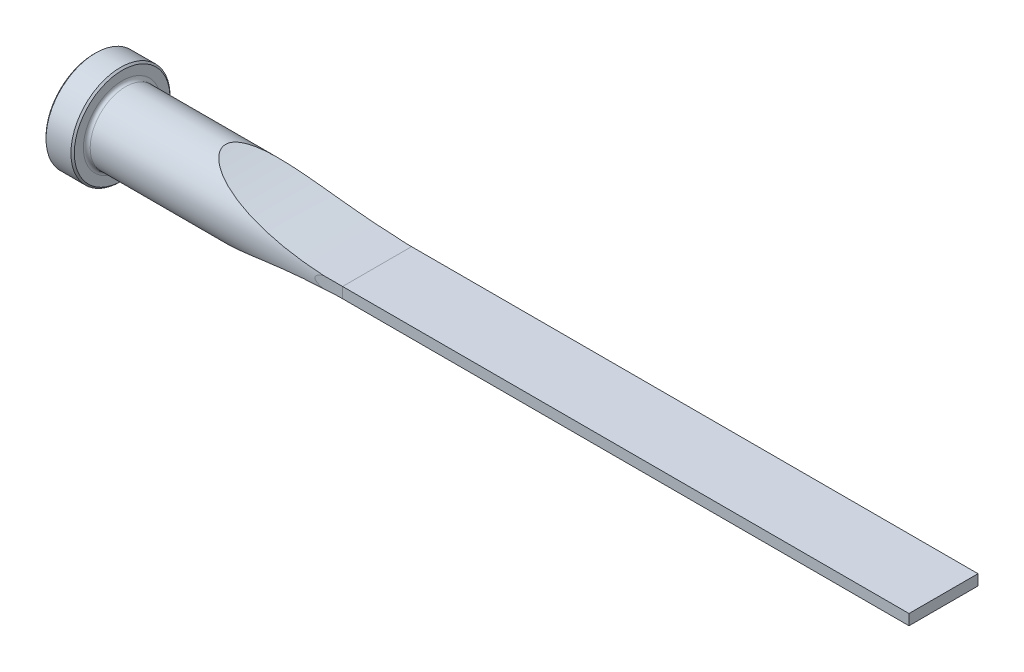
ISO-10303-21;
HEADER;
FILE_DESCRIPTION(('STEP AP214'),'2;1');
FILE_NAME('part.step','',(''),(''),'','','');
FILE_SCHEMA(('AUTOMOTIVE_DESIGN { 1 0 10303 214 1 1 1 1 }'));
ENDSEC;
DATA;
#1=APPLICATION_CONTEXT('core data for automotive mechanical design processes');
#2=APPLICATION_PROTOCOL_DEFINITION('international standard','automotive_design',2000,#1);
#3=PRODUCT_CONTEXT('',#1,'mechanical');
#4=PRODUCT('Part','Part','',(#3));
#5=PRODUCT_RELATED_PRODUCT_CATEGORY('part','',(#4));
#6=PRODUCT_DEFINITION_FORMATION('','',#4);
#7=PRODUCT_DEFINITION_CONTEXT('part definition',#1,'design');
#8=PRODUCT_DEFINITION('design','',#6,#7);
#9=PRODUCT_DEFINITION_SHAPE('','',#8);
#10=(LENGTH_UNIT() NAMED_UNIT(*) SI_UNIT(.MILLI.,.METRE.));
#11=(NAMED_UNIT(*) PLANE_ANGLE_UNIT() SI_UNIT($,.RADIAN.));
#12=(NAMED_UNIT(*) SI_UNIT($,.STERADIAN.) SOLID_ANGLE_UNIT());
#13=UNCERTAINTY_MEASURE_WITH_UNIT(LENGTH_MEASURE(1.E-05),#10,'distance_accuracy_value','');
#14=(GEOMETRIC_REPRESENTATION_CONTEXT(3) GLOBAL_UNCERTAINTY_ASSIGNED_CONTEXT((#13)) GLOBAL_UNIT_ASSIGNED_CONTEXT((#10,
#11,#12)) REPRESENTATION_CONTEXT('',''));
#15=CARTESIAN_POINT('',(0.,0.,0.));
#16=DIRECTION('',(0.,0.,1.));
#17=DIRECTION('',(1.,0.,0.));
#18=AXIS2_PLACEMENT_3D('',#15,#16,#17);
#19=CARTESIAN_POINT('',(0.,0.,0.));
#20=DIRECTION('',(-1.,0.,0.));
#21=DIRECTION('',(0.,0.,1.));
#22=AXIS2_PLACEMENT_3D('',#19,#20,#21);
#23=CYLINDRICAL_SURFACE('',#22,7.9375);
#24=CARTESIAN_POINT('',(7.112,0.,0.));
#25=DIRECTION('',(-1.,0.,0.));
#26=DIRECTION('',(0.,0.,1.));
#27=AXIS2_PLACEMENT_3D('',#24,#25,#26);
#28=CIRCLE('',#27,7.9375);
#29=CARTESIAN_POINT('',(7.112,0.,7.9375));
#30=VERTEX_POINT('',#29);
#31=EDGE_CURVE('E155',#30,#30,#28,.F.);
#32=ORIENTED_EDGE('',*,*,#31,.T.);
#33=EDGE_LOOP('',(#32));
#34=FACE_BOUND('',#33,.T.);
#35=CARTESIAN_POINT('',(63.5,1.78451947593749,7.73429999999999));
#36=CARTESIAN_POINT('',(63.3430656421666,1.78451054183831,7.73429977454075));
#37=CARTESIAN_POINT('',(63.1861350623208,1.78271922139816,7.73471557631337));
#38=CARTESIAN_POINT('',(62.8723492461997,1.77549817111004,7.73637727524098));
#39=CARTESIAN_POINT('',(62.7154940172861,1.77006813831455,7.73762324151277));
#40=CARTESIAN_POINT('',(62.2441822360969,1.74816345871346,7.74261393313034));
#41=CARTESIAN_POINT('',(61.9299817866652,1.72607327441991,7.74761144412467));
#42=CARTESIAN_POINT('',(61.2899690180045,1.66408626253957,7.76117477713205));
#43=CARTESIAN_POINT('',(60.9642250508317,1.62347858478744,7.76988203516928));
#44=CARTESIAN_POINT('',(60.4785569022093,1.5460805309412,7.78551205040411));
#45=CARTESIAN_POINT('',(60.3172623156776,1.51755721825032,7.79114576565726));
#46=CARTESIAN_POINT('',(59.995978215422,1.45411431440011,7.80323762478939));
#47=CARTESIAN_POINT('',(59.8359884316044,1.41919608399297,7.80969559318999));
#48=CARTESIAN_POINT('',(59.5504331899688,1.34959366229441,7.82198684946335));
#49=CARTESIAN_POINT('',(59.4245187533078,1.31632189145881,7.82767781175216));
#50=CARTESIAN_POINT('',(59.1742906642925,1.24389463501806,7.83951454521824));
#51=CARTESIAN_POINT('',(59.0499782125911,1.20473498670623,7.84566063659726));
#52=CARTESIAN_POINT('',(58.8046106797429,1.11932874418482,7.85829914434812));
#53=CARTESIAN_POINT('',(58.6835409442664,1.07312433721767,7.86478935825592));
#54=CARTESIAN_POINT('',(58.4455290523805,0.971242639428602,7.87802451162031));
#55=CARTESIAN_POINT('',(58.3285807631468,0.915580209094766,7.88476903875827));
#56=CARTESIAN_POINT('',(58.1332020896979,0.807942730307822,7.89640344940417));
#57=CARTESIAN_POINT('',(58.0530253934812,0.759165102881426,7.90129316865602));
#58=CARTESIAN_POINT('',(57.8993862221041,0.652026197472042,7.9108592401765));
#59=CARTESIAN_POINT('',(57.8258979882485,0.593704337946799,7.91553637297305));
#60=CARTESIAN_POINT('',(57.7277467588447,0.498492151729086,7.9218877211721));
#61=CARTESIAN_POINT('',(57.6980303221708,0.466875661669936,7.92382750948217));
#62=CARTESIAN_POINT('',(57.6425603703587,0.400245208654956,7.92747295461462));
#63=CARTESIAN_POINT('',(57.6168066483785,0.365231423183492,7.92917862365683));
#64=CARTESIAN_POINT('',(57.5744097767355,0.297054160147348,7.93200146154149));
#65=CARTESIAN_POINT('',(57.5569814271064,0.264389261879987,7.9331684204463));
#66=CARTESIAN_POINT('',(57.5276907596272,0.196640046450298,7.93513574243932));
#67=CARTESIAN_POINT('',(57.5158172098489,0.161560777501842,7.9359368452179));
#68=CARTESIAN_POINT('',(57.5003815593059,0.0956953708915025,7.93697969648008));
#69=CARTESIAN_POINT('',(57.4957692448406,0.0651593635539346,7.93729206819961));
#70=CARTESIAN_POINT('',(57.491836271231,0.00374737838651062,7.93755838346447));
#71=CARTESIAN_POINT('',(57.4925133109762,-0.0271284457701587,7.9375124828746));
#72=CARTESIAN_POINT('',(57.4990749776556,-0.0882381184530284,7.93706831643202));
#73=CARTESIAN_POINT('',(57.5049486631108,-0.118473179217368,7.936670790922));
#74=CARTESIAN_POINT('',(57.5213031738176,-0.177660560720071,7.93556691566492));
#75=CARTESIAN_POINT('',(57.5317886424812,-0.206611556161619,7.9348602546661));
#76=CARTESIAN_POINT('',(57.5626598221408,-0.276684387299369,7.93278744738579));
#77=CARTESIAN_POINT('',(57.5853777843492,-0.316766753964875,7.93126793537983));
#78=CARTESIAN_POINT('',(57.6366991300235,-0.39292597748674,7.92786070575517));
#79=CARTESIAN_POINT('',(57.6653178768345,-0.428991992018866,7.92597202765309));
#80=CARTESIAN_POINT('',(57.7519576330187,-0.525999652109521,7.92030384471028));
#81=CARTESIAN_POINT('',(57.8146458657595,-0.582701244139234,7.91625752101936));
#82=CARTESIAN_POINT('',(57.946996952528,-0.687133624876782,7.90787418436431));
#83=CARTESIAN_POINT('',(58.0166818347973,-0.73483462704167,7.90353626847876));
#84=CARTESIAN_POINT('',(58.1980649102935,-0.847009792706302,7.89247512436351));
#85=CARTESIAN_POINT('',(58.3124942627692,-0.90701549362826,7.88570351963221));
#86=CARTESIAN_POINT('',(58.5463942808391,-1.0164466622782,7.87233944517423));
#87=CARTESIAN_POINT('',(58.6658758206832,-1.06584775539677,7.86574741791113));
#88=CARTESIAN_POINT('',(58.9089635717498,-1.15711870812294,7.85284174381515));
#89=CARTESIAN_POINT('',(59.0325981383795,-1.19891277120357,7.8465313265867));
#90=CARTESIAN_POINT('',(59.2816923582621,-1.27609049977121,7.83434823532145));
#91=CARTESIAN_POINT('',(59.4071499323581,-1.31148093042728,7.82847510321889));
#92=CARTESIAN_POINT('',(59.6993409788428,-1.38743337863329,7.81542475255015));
#93=CARTESIAN_POINT('',(59.8665757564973,-1.42608925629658,7.8084228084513));
#94=CARTESIAN_POINT('',(60.2026202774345,-1.49607651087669,7.79531303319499));
#95=CARTESIAN_POINT('',(60.3714304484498,-1.52740583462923,7.78920545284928));
#96=CARTESIAN_POINT('',(60.8800454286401,-1.61220099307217,7.77226680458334));
#97=CARTESIAN_POINT('',(61.2214646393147,-1.65633549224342,7.76284544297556));
#98=CARTESIAN_POINT('',(61.8861149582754,-1.72271499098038,7.74836524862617));
#99=CARTESIAN_POINT('',(62.2092344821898,-1.74609496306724,7.74308238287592));
#100=CARTESIAN_POINT('',(62.6938210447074,-1.76925595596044,7.73780942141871));
#101=CARTESIAN_POINT('',(62.8550077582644,-1.77499180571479,7.73649365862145));
#102=CARTESIAN_POINT('',(63.1774617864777,-1.78261828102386,7.73473885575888));
#103=CARTESIAN_POINT('',(63.3387290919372,-1.78450927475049,7.73429973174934));
#104=CARTESIAN_POINT('',(63.5,-1.78451947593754,7.73429999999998));
#105=B_SPLINE_CURVE_WITH_KNOTS('',3,(#35,#36,#37,#38,#39,#40,#41,#42,#43,#44,#45,#46,#47,#48,
#49,#50,#51,#52,#53,#54,#55,#56,#57,#58,#59,#60,#61,#62,#63,#64,#65,#66,#67,#68,#69,#70,#71,#72,
#73,#74,#75,#76,#77,#78,#79,#80,#81,#82,#83,#84,#85,#86,#87,#88,#89,#90,#91,#92,#93,#94,#95,#96,
#97,#98,#99,#100,#101,#102,#103,#104),.UNSPECIFIED.,.F.,.F.,(4,2,2,2,2,2,2,2,2,2,2,2,2,2,2,2,2,
2,2,2,2,2,2,2,2,2,2,2,2,2,2,2,2,2,4),(0.,0.470784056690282,0.941607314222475,1.886257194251,
2.87069717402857,3.36228091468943,3.85376017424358,4.24473219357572,4.63598193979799,
5.02497459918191,5.41336162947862,5.69491367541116,5.97533094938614,6.10540702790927,
6.23547631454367,6.34621180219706,6.45672240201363,6.54894631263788,6.64113010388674,
6.7331202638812,6.82520325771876,6.96270105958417,7.10056147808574,7.3530071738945,
7.60627419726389,7.99346510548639,8.38153665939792,8.77328533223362,9.16461769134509,
9.67975694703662,10.1950403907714,11.2273641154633,12.1989586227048,12.6827980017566,
13.1665910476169),.UNSPECIFIED.);
#106=CARTESIAN_POINT('',(59.3382987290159,1.29126488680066,7.83176488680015));
#107=VERTEX_POINT('',#106);
#108=CARTESIAN_POINT('',(59.3382987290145,-1.2912648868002,7.8317648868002));
#109=VERTEX_POINT('',#108);
#110=EDGE_CURVE('E158',#107,#109,#105,.T.);
#111=ORIENTED_EDGE('',*,*,#110,.F.);
#112=CARTESIAN_POINT('',(63.5,1.19379999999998,7.84721274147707));
#113=CARTESIAN_POINT('',(62.8381225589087,1.19379851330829,7.84716668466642));
#114=CARTESIAN_POINT('',(62.1762440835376,1.20119165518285,7.84608652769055));
#115=CARTESIAN_POINT('',(60.8528175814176,1.23075682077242,7.84152806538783));
#116=CARTESIAN_POINT('',(60.1912695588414,1.252929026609,7.83804973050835));
#117=CARTESIAN_POINT('',(58.8684679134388,1.31205914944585,7.82836213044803));
#118=CARTESIAN_POINT('',(58.2072146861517,1.34902566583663,7.82215127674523));
#119=CARTESIAN_POINT('',(56.8857412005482,1.43772230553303,7.80633747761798));
#120=CARTESIAN_POINT('',(56.2255209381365,1.48945237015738,7.79673454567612));
#121=CARTESIAN_POINT('',(54.9001573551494,1.60821016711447,7.77311170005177));
#122=CARTESIAN_POINT('',(54.2350274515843,1.67537967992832,7.75905035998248));
#123=CARTESIAN_POINT('',(52.9065921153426,1.82468616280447,7.72530187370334));
#124=CARTESIAN_POINT('',(52.2432866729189,1.90682305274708,7.7056147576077));
#125=CARTESIAN_POINT('',(50.919144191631,2.08596914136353,7.65906016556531));
#126=CARTESIAN_POINT('',(50.2583064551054,2.18297374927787,7.63219490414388));
#127=CARTESIAN_POINT('',(48.9394125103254,2.39177601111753,7.56936059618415));
#128=CARTESIAN_POINT('',(48.2813562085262,2.50357316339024,7.53339185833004));
#129=CARTESIAN_POINT('',(47.171084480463,2.70507435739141,7.46284612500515));
#130=CARTESIAN_POINT('',(46.7179820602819,2.79095736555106,7.43126157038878));
#131=CARTESIAN_POINT('',(45.8136463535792,2.96966261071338,7.36167196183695));
#132=CARTESIAN_POINT('',(45.3624130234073,3.06248468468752,7.32366705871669));
#133=CARTESIAN_POINT('',(44.4619346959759,3.25501760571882,7.24015077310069));
#134=CARTESIAN_POINT('',(44.0126904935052,3.35473098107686,7.19463662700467));
#135=CARTESIAN_POINT('',(43.1167218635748,3.56089713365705,7.09485996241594));
#136=CARTESIAN_POINT('',(42.6699974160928,3.66734985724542,7.04059751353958));
#137=CARTESIAN_POINT('',(41.7802999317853,3.88664158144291,6.92195377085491));
#138=CARTESIAN_POINT('',(41.337321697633,3.99946907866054,6.85759035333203));
#139=CARTESIAN_POINT('',(40.4548919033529,4.23146181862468,6.71692258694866));
#140=CARTESIAN_POINT('',(40.0154405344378,4.35062740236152,6.64061759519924));
#141=CARTESIAN_POINT('',(39.1412033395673,4.5948829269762,6.4740104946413));
#142=CARTESIAN_POINT('',(38.7064142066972,4.71996827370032,6.38371912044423));
#143=CARTESIAN_POINT('',(37.8423214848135,4.97566731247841,6.18649470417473));
#144=CARTESIAN_POINT('',(37.4130170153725,5.10628010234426,6.07956437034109));
#145=CARTESIAN_POINT('',(36.5585839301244,5.37325026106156,5.84499309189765));
#146=CARTESIAN_POINT('',(36.1334996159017,5.50963904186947,5.71722399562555));
#147=CARTESIAN_POINT('',(35.5028399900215,5.71715543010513,5.50705769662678));
#148=CARTESIAN_POINT('',(35.2937011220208,5.78684415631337,5.43388469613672));
#149=CARTESIAN_POINT('',(34.8782231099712,5.92698991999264,5.28067158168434));
#150=CARTESIAN_POINT('',(34.6718837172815,5.99744688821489,5.20063208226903));
#151=CARTESIAN_POINT('',(34.2624862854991,6.13890315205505,5.03287331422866));
#152=CARTESIAN_POINT('',(34.0594287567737,6.20990252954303,4.9451528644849));
#153=CARTESIAN_POINT('',(33.6573239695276,6.35211292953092,4.76110246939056));
#154=CARTESIAN_POINT('',(33.4582764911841,6.4233239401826,4.66477299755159));
#155=CARTESIAN_POINT('',(33.0653759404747,6.56543819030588,4.46253127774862));
#156=CARTESIAN_POINT('',(32.8715156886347,6.6363417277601,4.35663326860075));
#157=CARTESIAN_POINT('',(32.4898571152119,6.77740049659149,4.13378159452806));
#158=CARTESIAN_POINT('',(32.3020603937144,6.84755552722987,4.01682504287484));
#159=CARTESIAN_POINT('',(31.9316775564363,6.9872977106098,3.76857573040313));
#160=CARTESIAN_POINT('',(31.7492017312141,7.05686303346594,3.6371046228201));
#161=CARTESIAN_POINT('',(31.3948684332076,7.19321792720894,3.35938146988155));
#162=CARTESIAN_POINT('',(31.2230033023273,7.26000948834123,3.21314029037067));
#163=CARTESIAN_POINT('',(30.8945020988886,7.38876758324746,2.904780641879));
#164=CARTESIAN_POINT('',(30.737765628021,7.45076529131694,2.74278358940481));
#165=CARTESIAN_POINT('',(30.4434523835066,7.56804849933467,2.40025613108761));
#166=CARTESIAN_POINT('',(30.3058389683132,7.62334680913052,2.21976235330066));
#167=CARTESIAN_POINT('',(30.078125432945,7.71540027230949,1.87164686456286));
#168=CARTESIAN_POINT('',(29.9839241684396,7.7537088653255,1.70715476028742));
#169=CARTESIAN_POINT('',(29.8186031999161,7.82119517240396,1.36497629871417));
#170=CARTESIAN_POINT('',(29.747479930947,7.85037429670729,1.18729198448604));
#171=CARTESIAN_POINT('',(29.6334274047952,7.8972721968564,0.819510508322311));
#172=CARTESIAN_POINT('',(29.5907739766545,7.91487882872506,0.629310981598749));
#173=CARTESIAN_POINT('',(29.5393844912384,7.93610136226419,0.243645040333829));
#174=CARTESIAN_POINT('',(29.5306150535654,7.93973103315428,0.0481840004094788));
#175=CARTESIAN_POINT('',(29.5471406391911,7.93290086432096,-0.322926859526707));
#176=CARTESIAN_POINT('',(29.5693808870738,7.92370449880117,-0.498747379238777));
#177=CARTESIAN_POINT('',(29.6404124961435,7.89440962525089,-0.843970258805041));
#178=CARTESIAN_POINT('',(29.68922187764,7.8743037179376,-1.01336817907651));
#179=CARTESIAN_POINT('',(29.8286223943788,7.81709861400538,-1.39459952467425));
#180=CARTESIAN_POINT('',(29.9275563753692,7.77663185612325,-1.60284534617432));
#181=CARTESIAN_POINT('',(30.1550722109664,7.68420831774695,-1.99966034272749));
#182=CARTESIAN_POINT('',(30.2837197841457,7.63222607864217,-2.18818453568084));
#183=CARTESIAN_POINT('',(30.5359785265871,7.53110769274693,-2.51183783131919));
#184=CARTESIAN_POINT('',(30.655921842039,7.48329986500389,-2.65031432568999));
#185=CARTESIAN_POINT('',(30.9068069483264,7.38399425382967,-2.91558098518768));
#186=CARTESIAN_POINT('',(31.0377560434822,7.33249402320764,-3.04236327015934));
#187=CARTESIAN_POINT('',(31.3083723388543,7.22685692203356,-3.28542663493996));
#188=CARTESIAN_POINT('',(31.4480524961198,7.17271616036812,-3.40169144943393));
#189=CARTESIAN_POINT('',(31.7342331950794,7.06266378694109,-3.62465772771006));
#190=CARTESIAN_POINT('',(31.8807364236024,7.00675148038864,-3.731355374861));
#191=CARTESIAN_POINT('',(32.1815574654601,6.89288997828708,-3.93777729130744));
#192=CARTESIAN_POINT('',(32.3359625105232,6.83492252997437,-4.03736365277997));
#193=CARTESIAN_POINT('',(32.6493699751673,6.71828422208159,-4.22860342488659));
#194=CARTESIAN_POINT('',(32.8083733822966,6.65961321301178,-4.32025511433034));
#195=CARTESIAN_POINT('',(33.2912686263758,6.48303600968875,-4.5846763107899));
#196=CARTESIAN_POINT('',(33.6208422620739,6.36464275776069,-4.74677634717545));
#197=CARTESIAN_POINT('',(34.2913171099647,6.12839235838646,-5.0481048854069));
#198=CARTESIAN_POINT('',(34.6322435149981,6.01053716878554,-5.18727779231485));
#199=CARTESIAN_POINT('',(35.1494516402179,5.83533109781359,-5.38148407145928));
#200=CARTESIAN_POINT('',(35.3227893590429,5.77720316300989,-5.44378313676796));
#201=CARTESIAN_POINT('',(35.6712062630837,5.66156728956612,-5.56394848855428));
#202=CARTESIAN_POINT('',(35.8462854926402,5.60405936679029,-5.62181466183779));
#203=CARTESIAN_POINT('',(36.2998733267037,5.45664278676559,-5.76583857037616));
#204=CARTESIAN_POINT('',(36.5795226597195,5.36727072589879,-5.84895807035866));
#205=CARTESIAN_POINT('',(37.1419843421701,5.19060845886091,-6.00628600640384));
#206=CARTESIAN_POINT('',(37.4247970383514,5.10331848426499,-6.08049345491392));
#207=CARTESIAN_POINT('',(37.9931762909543,4.93101376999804,-6.22104308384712));
#208=CARTESIAN_POINT('',(38.278743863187,4.84599991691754,-6.28738223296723));
#209=CARTESIAN_POINT('',(38.8521480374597,4.67844630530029,-6.41303308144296));
#210=CARTESIAN_POINT('',(39.1399847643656,4.59590668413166,-6.4723443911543));
#211=CARTESIAN_POINT('',(40.007471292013,4.35190669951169,-6.64109187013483));
#212=CARTESIAN_POINT('',(40.5900768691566,4.19437492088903,-6.74109544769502));
#213=CARTESIAN_POINT('',(41.7611142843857,3.89057004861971,-6.92086963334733));
#214=CARTESIAN_POINT('',(42.3495450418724,3.74429490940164,-7.00064392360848));
#215=CARTESIAN_POINT('',(43.5344127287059,3.46263830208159,-7.14416923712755));
#216=CARTESIAN_POINT('',(44.1308759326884,3.32732150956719,-7.2078292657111));
#217=CARTESIAN_POINT('',(45.3277040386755,3.0687891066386,-7.32163713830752));
#218=CARTESIAN_POINT('',(45.9280691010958,2.94557399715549,-7.37178442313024));
#219=CARTESIAN_POINT('',(47.131402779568,2.71156862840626,-7.4610292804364));
#220=CARTESIAN_POINT('',(47.7343682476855,2.60076624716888,-7.50013769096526));
#221=CARTESIAN_POINT('',(48.942941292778,2.39158711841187,-7.56943539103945));
#222=CARTESIAN_POINT('',(49.5485488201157,2.29321013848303,-7.59962484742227));
#223=CARTESIAN_POINT('',(50.710548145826,2.11678375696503,-7.65054390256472));
#224=CARTESIAN_POINT('',(51.2667608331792,2.03771816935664,-7.67185841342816));
#225=CARTESIAN_POINT('',(52.3807461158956,1.89012729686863,-7.70954773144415));
#226=CARTESIAN_POINT('',(52.938518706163,1.8216019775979,-7.72592255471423));
#227=CARTESIAN_POINT('',(54.055497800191,1.69511580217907,-7.75465627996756));
#228=CARTESIAN_POINT('',(54.6147046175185,1.63715749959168,-7.76701421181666));
#229=CARTESIAN_POINT('',(55.7341794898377,1.53185494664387,-7.78846665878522));
#230=CARTESIAN_POINT('',(56.2944475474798,1.4845107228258,-7.79756116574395));
#231=CARTESIAN_POINT('',(57.407895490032,1.40105211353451,-7.81298502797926));
#232=CARTESIAN_POINT('',(57.9610636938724,1.36478853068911,-7.81935163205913));
#233=CARTESIAN_POINT('',(59.0680015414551,1.30261413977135,-7.82994828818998));
#234=CARTESIAN_POINT('',(59.6217711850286,1.27670332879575,-7.83417834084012));
#235=CARTESIAN_POINT('',(60.7295192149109,1.23525213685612,-7.84082420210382));
#236=CARTESIAN_POINT('',(61.2834974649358,1.21970821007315,-7.84324063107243));
#237=CARTESIAN_POINT('',(62.3916506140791,1.19898179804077,-7.84642359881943));
#238=CARTESIAN_POINT('',(62.9458255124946,1.19379927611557,-7.84719014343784));
#239=CARTESIAN_POINT('',(63.5,1.19379999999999,-7.84721274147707));
#240=B_SPLINE_CURVE_WITH_KNOTS('',3,(#112,#113,#114,#115,#116,#117,#118,#119,#120,#121,#122,
#123,#124,#125,#126,#127,#128,#129,#130,#131,#132,#133,#134,#135,#136,#137,#138,#139,#140,#141,
#142,#143,#144,#145,#146,#147,#148,#149,#150,#151,#152,#153,#154,#155,#156,#157,#158,#159,#160,
#161,#162,#163,#164,#165,#166,#167,#168,#169,#170,#171,#172,#173,#174,#175,#176,#177,#178,#179,
#180,#181,#182,#183,#184,#185,#186,#187,#188,#189,#190,#191,#192,#193,#194,#195,#196,#197,#198,
#199,#200,#201,#202,#203,#204,#205,#206,#207,#208,#209,#210,#211,#212,#213,#214,#215,#216,#217,
#218,#219,#220,#221,#222,#223,#224,#225,#226,#227,#228,#229,#230,#231,#232,#233,#234,#235,#236,
#237,#238,#239),.UNSPECIFIED.,.F.,.F.,(4,2,2,2,2,2,2,2,2,2,2,2,2,2,2,2,2,2,2,2,2,2,2,2,2,2,2,2,
2,2,2,2,2,2,2,2,2,2,2,2,2,2,2,2,2,2,2,2,2,2,2,2,2,2,2,2,2,2,2,2,2,2,2,4),(0.,1.98559182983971,
3.97120812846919,5.95798027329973,7.9447445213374,9.95053869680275,11.9563221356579,
13.9614874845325,15.9665848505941,17.3532477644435,18.7398781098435,20.1270199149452,
21.5141506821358,22.898853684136,24.2836312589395,25.6673512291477,27.0508462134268,
28.4431943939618,29.1399116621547,29.8365666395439,30.5333289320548,31.2300529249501,
31.9257566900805,32.6216425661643,33.3273063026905,34.0324546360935,34.7325447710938,
35.4312744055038,36.009767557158,36.5881713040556,37.1721005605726,37.7554544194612,
38.2852283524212,38.815362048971,39.5136870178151,40.2135715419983,40.780788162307,
41.3483842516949,41.9168436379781,42.485528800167,43.0632591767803,43.6411145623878,
44.7975912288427,45.9568321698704,46.5362242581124,47.1156311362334,48.0308127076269,
48.946095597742,49.8617299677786,50.7774150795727,52.6120655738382,54.4463818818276,
56.2908361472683,58.1353667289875,59.9780799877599,61.8207587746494,63.5072591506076,
65.1937540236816,66.8806559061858,68.5675620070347,70.230636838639,71.8937112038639,
73.5562164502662,75.2187158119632),.UNSPECIFIED.);
#241=CARTESIAN_POINT('',(59.3382987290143,1.29126488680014,-7.83176488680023));
#242=VERTEX_POINT('',#241);
#243=EDGE_CURVE('E108',#107,#242,#240,.T.);
#244=ORIENTED_EDGE('',*,*,#243,.T.);
#245=CARTESIAN_POINT('',(63.5,1.78451947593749,-7.73429999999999));
#246=CARTESIAN_POINT('',(63.3430656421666,1.78451054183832,-7.73429977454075));
#247=CARTESIAN_POINT('',(63.1861350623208,1.78271922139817,-7.73471557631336));
#248=CARTESIAN_POINT('',(62.8723492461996,1.77549817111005,-7.73637727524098));
#249=CARTESIAN_POINT('',(62.715494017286,1.77006813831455,-7.73762324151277));
#250=CARTESIAN_POINT('',(62.2441822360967,1.74816345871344,-7.74261393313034));
#251=CARTESIAN_POINT('',(61.929981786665,1.72607327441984,-7.74761144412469));
#252=CARTESIAN_POINT('',(61.2899690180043,1.66408626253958,-7.76117477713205));
#253=CARTESIAN_POINT('',(60.9642250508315,1.62347858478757,-7.76988203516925));
#254=CARTESIAN_POINT('',(60.4785569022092,1.54608053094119,-7.78551205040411));
#255=CARTESIAN_POINT('',(60.3172623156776,1.51755721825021,-7.79114576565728));
#256=CARTESIAN_POINT('',(59.995978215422,1.45411431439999,-7.80323762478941));
#257=CARTESIAN_POINT('',(59.8359884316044,1.41919608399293,-7.80969559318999));
#258=CARTESIAN_POINT('',(59.5504331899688,1.34959366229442,-7.82198684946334));
#259=CARTESIAN_POINT('',(59.4245187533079,1.31632189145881,-7.82767781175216));
#260=CARTESIAN_POINT('',(59.1742906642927,1.24389463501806,-7.83951454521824));
#261=CARTESIAN_POINT('',(59.0499782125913,1.20473498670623,-7.84566063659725));
#262=CARTESIAN_POINT('',(58.8046106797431,1.11932874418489,-7.85829914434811));
#263=CARTESIAN_POINT('',(58.6835409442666,1.07312433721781,-7.8647893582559));
#264=CARTESIAN_POINT('',(58.4455290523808,0.971242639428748,-7.87802451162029));
#265=CARTESIAN_POINT('',(58.3285807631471,0.915580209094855,-7.88476903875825));
#266=CARTESIAN_POINT('',(58.1332020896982,0.807942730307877,-7.89640344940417));
#267=CARTESIAN_POINT('',(58.0530253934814,0.759165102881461,-7.90129316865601));
#268=CARTESIAN_POINT('',(57.8993862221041,0.652026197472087,-7.91085924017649));
#269=CARTESIAN_POINT('',(57.8258979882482,0.593704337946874,-7.91553637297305));
#270=CARTESIAN_POINT('',(57.7277467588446,0.49849215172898,-7.9218877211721));
#271=CARTESIAN_POINT('',(57.6980303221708,0.46687566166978,-7.92382750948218));
#272=CARTESIAN_POINT('',(57.6425603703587,0.40024520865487,-7.92747295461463));
#273=CARTESIAN_POINT('',(57.6168066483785,0.365231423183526,-7.92917862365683));
#274=CARTESIAN_POINT('',(57.5744097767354,0.297054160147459,-7.93200146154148));
#275=CARTESIAN_POINT('',(57.5569814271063,0.264389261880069,-7.93316842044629));
#276=CARTESIAN_POINT('',(57.5276907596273,0.196640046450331,-7.93513574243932));
#277=CARTESIAN_POINT('',(57.5158172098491,0.161560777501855,-7.9359368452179));
#278=CARTESIAN_POINT('',(57.5003815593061,0.0956953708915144,-7.93697969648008));
#279=CARTESIAN_POINT('',(57.4957692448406,0.0651593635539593,-7.93729206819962));
#280=CARTESIAN_POINT('',(57.491836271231,0.00374737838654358,-7.93755838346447));
#281=CARTESIAN_POINT('',(57.4925133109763,-0.0271284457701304,-7.9375124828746));
#282=CARTESIAN_POINT('',(57.4990749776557,-0.0882381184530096,-7.93706831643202));
#283=CARTESIAN_POINT('',(57.5049486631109,-0.118473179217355,-7.936670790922));
#284=CARTESIAN_POINT('',(57.5213031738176,-0.177660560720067,-7.93556691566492));
#285=CARTESIAN_POINT('',(57.5317886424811,-0.20661155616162,-7.9348602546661));
#286=CARTESIAN_POINT('',(57.5626598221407,-0.276684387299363,-7.93278744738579));
#287=CARTESIAN_POINT('',(57.5853777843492,-0.31676675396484,-7.93126793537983));
#288=CARTESIAN_POINT('',(57.6366991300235,-0.392925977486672,-7.92786070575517));
#289=CARTESIAN_POINT('',(57.6653178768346,-0.428991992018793,-7.92597202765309));
#290=CARTESIAN_POINT('',(57.7519576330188,-0.52599965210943,-7.92030384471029));
#291=CARTESIAN_POINT('',(57.8146458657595,-0.582701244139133,-7.91625752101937));
#292=CARTESIAN_POINT('',(57.9469969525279,-0.687133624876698,-7.90787418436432));
#293=CARTESIAN_POINT('',(58.0166818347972,-0.734834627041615,-7.90353626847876));
#294=CARTESIAN_POINT('',(58.1980649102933,-0.847009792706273,-7.89247512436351));
#295=CARTESIAN_POINT('',(58.3124942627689,-0.907015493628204,-7.88570351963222));
#296=CARTESIAN_POINT('',(58.5463942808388,-1.01644666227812,-7.87233944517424));
#297=CARTESIAN_POINT('',(58.6658758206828,-1.06584775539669,-7.86574741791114));
#298=CARTESIAN_POINT('',(58.9089635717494,-1.15711870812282,-7.85284174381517));
#299=CARTESIAN_POINT('',(59.0325981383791,-1.1989127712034,-7.84653132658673));
#300=CARTESIAN_POINT('',(59.2816923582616,-1.27609049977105,-7.83434823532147));
#301=CARTESIAN_POINT('',(59.4071499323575,-1.31148093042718,-7.82847510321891));
#302=CARTESIAN_POINT('',(59.6993409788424,-1.38743337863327,-7.81542475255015));
#303=CARTESIAN_POINT('',(59.8665757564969,-1.42608925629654,-7.80842280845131));
#304=CARTESIAN_POINT('',(60.2026202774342,-1.49607651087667,-7.79531303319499));
#305=CARTESIAN_POINT('',(60.3714304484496,-1.52740583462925,-7.78920545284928));
#306=CARTESIAN_POINT('',(60.8800454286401,-1.61220099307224,-7.77226680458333));
#307=CARTESIAN_POINT('',(61.2214646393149,-1.65633549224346,-7.76284544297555));
#308=CARTESIAN_POINT('',(61.8861149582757,-1.72271499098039,-7.74836524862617));
#309=CARTESIAN_POINT('',(62.2092344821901,-1.74609496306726,-7.74308238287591));
#310=CARTESIAN_POINT('',(62.6938210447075,-1.76925595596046,-7.7378094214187));
#311=CARTESIAN_POINT('',(62.8550077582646,-1.7749918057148,-7.73649365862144));
#312=CARTESIAN_POINT('',(63.1774617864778,-1.78261828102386,-7.73473885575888));
#313=CARTESIAN_POINT('',(63.3387290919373,-1.78450927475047,-7.73429973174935));
#314=CARTESIAN_POINT('',(63.5,-1.78451947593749,-7.73429999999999));
#315=B_SPLINE_CURVE_WITH_KNOTS('',3,(#245,#246,#247,#248,#249,#250,#251,#252,#253,#254,#255,
#256,#257,#258,#259,#260,#261,#262,#263,#264,#265,#266,#267,#268,#269,#270,#271,#272,#273,#274,
#275,#276,#277,#278,#279,#280,#281,#282,#283,#284,#285,#286,#287,#288,#289,#290,#291,#292,#293,
#294,#295,#296,#297,#298,#299,#300,#301,#302,#303,#304,#305,#306,#307,#308,#309,#310,#311,#312,
#313,#314),.UNSPECIFIED.,.F.,.F.,(4,2,2,2,2,2,2,2,2,2,2,2,2,2,2,2,2,2,2,2,2,2,2,2,2,2,2,2,2,2,2,
2,2,2,4),(0.,0.470784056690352,0.9416073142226,1.88625719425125,2.8706971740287,
3.36228091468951,3.8537601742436,4.24473219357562,4.63598193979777,5.02497459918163,
5.41336162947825,5.69491367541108,5.97533094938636,6.10540702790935,6.2354763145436,
6.34621180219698,6.45672240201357,6.54894631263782,6.6411301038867,6.73312026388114,
6.82520325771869,6.96270105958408,7.10056147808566,7.35300717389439,7.60627419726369,
7.99346510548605,8.38153665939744,8.77328533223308,9.16461769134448,9.67975694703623,
10.1950403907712,11.2273641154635,12.198958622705,12.6827980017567,13.1665910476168),.UNSPECIFIED.);
#316=CARTESIAN_POINT('',(59.3382987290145,-1.2912648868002,-7.8317648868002));
#317=VERTEX_POINT('',#316);
#318=EDGE_CURVE('E177',#242,#317,#315,.T.);
#319=ORIENTED_EDGE('',*,*,#318,.T.);
#320=CARTESIAN_POINT('',(63.5,-1.19379999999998,7.84721274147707));
#321=CARTESIAN_POINT('',(62.8381225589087,-1.1937985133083,7.84716668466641));
#322=CARTESIAN_POINT('',(62.1762440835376,-1.20119165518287,7.84608652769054));
#323=CARTESIAN_POINT('',(60.8528175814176,-1.23075682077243,7.84152806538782));
#324=CARTESIAN_POINT('',(60.1912695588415,-1.252929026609,7.83804973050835));
#325=CARTESIAN_POINT('',(58.8684679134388,-1.31205914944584,7.82836213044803));
#326=CARTESIAN_POINT('',(58.2072146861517,-1.34902566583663,7.82215127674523));
#327=CARTESIAN_POINT('',(56.8857412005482,-1.43772230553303,7.80633747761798));
#328=CARTESIAN_POINT('',(56.2255209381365,-1.48945237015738,7.79673454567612));
#329=CARTESIAN_POINT('',(54.9001573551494,-1.60821016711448,7.77311170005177));
#330=CARTESIAN_POINT('',(54.2350274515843,-1.67537967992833,7.75905035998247));
#331=CARTESIAN_POINT('',(52.9065921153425,-1.82468616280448,7.72530187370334));
#332=CARTESIAN_POINT('',(52.2432866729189,-1.90682305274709,7.7056147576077));
#333=CARTESIAN_POINT('',(50.919144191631,-2.08596914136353,7.65906016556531));
#334=CARTESIAN_POINT('',(50.2583064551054,-2.18297374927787,7.63219490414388));
#335=CARTESIAN_POINT('',(48.9394125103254,-2.39177601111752,7.56936059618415));
#336=CARTESIAN_POINT('',(48.2813562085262,-2.50357316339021,7.53339185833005));
#337=CARTESIAN_POINT('',(47.171084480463,-2.7050743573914,7.46284612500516));
#338=CARTESIAN_POINT('',(46.7179820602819,-2.79095736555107,7.43126157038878));
#339=CARTESIAN_POINT('',(45.8136463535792,-2.96966261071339,7.36167196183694));
#340=CARTESIAN_POINT('',(45.3624130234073,-3.06248468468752,7.32366705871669));
#341=CARTESIAN_POINT('',(44.4619346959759,-3.25501760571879,7.2401507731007));
#342=CARTESIAN_POINT('',(44.0126904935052,-3.35473098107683,7.19463662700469));
#343=CARTESIAN_POINT('',(43.1167218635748,-3.56089713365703,7.09485996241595));
#344=CARTESIAN_POINT('',(42.6699974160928,-3.6673498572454,7.04059751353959));
#345=CARTESIAN_POINT('',(41.7802999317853,-3.88664158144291,6.92195377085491));
#346=CARTESIAN_POINT('',(41.3373216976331,-3.99946907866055,6.85759035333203));
#347=CARTESIAN_POINT('',(40.4548919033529,-4.23146181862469,6.71692258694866));
#348=CARTESIAN_POINT('',(40.0154405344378,-4.35062740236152,6.64061759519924));
#349=CARTESIAN_POINT('',(39.1412033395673,-4.59488292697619,6.4740104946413));
#350=CARTESIAN_POINT('',(38.7064142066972,-4.71996827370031,6.38371912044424));
#351=CARTESIAN_POINT('',(37.8423214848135,-4.9756673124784,6.18649470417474));
#352=CARTESIAN_POINT('',(37.4130170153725,-5.10628010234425,6.0795643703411));
#353=CARTESIAN_POINT('',(36.5585839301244,-5.37325026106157,5.84499309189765));
#354=CARTESIAN_POINT('',(36.1334996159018,-5.50963904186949,5.71722399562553));
#355=CARTESIAN_POINT('',(35.5028399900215,-5.71715543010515,5.50705769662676));
#356=CARTESIAN_POINT('',(35.2937011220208,-5.78684415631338,5.43388469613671));
#357=CARTESIAN_POINT('',(34.8782231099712,-5.92698991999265,5.28067158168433));
#358=CARTESIAN_POINT('',(34.6718837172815,-5.99744688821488,5.20063208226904));
#359=CARTESIAN_POINT('',(34.2624862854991,-6.13890315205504,5.03287331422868));
#360=CARTESIAN_POINT('',(34.0594287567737,-6.20990252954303,4.94515286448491));
#361=CARTESIAN_POINT('',(33.6573239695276,-6.35211292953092,4.76110246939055));
#362=CARTESIAN_POINT('',(33.4582764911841,-6.4233239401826,4.66477299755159));
#363=CARTESIAN_POINT('',(33.0653759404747,-6.56543819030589,4.46253127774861));
#364=CARTESIAN_POINT('',(32.8715156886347,-6.63634172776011,4.35663326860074));
#365=CARTESIAN_POINT('',(32.4898571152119,-6.77740049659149,4.13378159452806));
#366=CARTESIAN_POINT('',(32.3020603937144,-6.84755552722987,4.01682504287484));
#367=CARTESIAN_POINT('',(31.9316775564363,-6.9872977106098,3.76857573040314));
#368=CARTESIAN_POINT('',(31.749201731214,-7.05686303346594,3.63710462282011));
#369=CARTESIAN_POINT('',(31.3948684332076,-7.19321792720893,3.35938146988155));
#370=CARTESIAN_POINT('',(31.2230033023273,-7.26000948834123,3.21314029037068));
#371=CARTESIAN_POINT('',(30.8945020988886,-7.38876758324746,2.904780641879));
#372=CARTESIAN_POINT('',(30.737765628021,-7.45076529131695,2.7427835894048));
#373=CARTESIAN_POINT('',(30.4434523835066,-7.56804849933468,2.40025613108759));
#374=CARTESIAN_POINT('',(30.3058389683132,-7.62334680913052,2.21976235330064));
#375=CARTESIAN_POINT('',(30.078125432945,-7.7154002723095,1.87164686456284));
#376=CARTESIAN_POINT('',(29.9839241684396,-7.75370886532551,1.70715476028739));
#377=CARTESIAN_POINT('',(29.8186031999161,-7.82119517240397,1.36497629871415));
#378=CARTESIAN_POINT('',(29.747479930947,-7.8503742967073,1.18729198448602));
#379=CARTESIAN_POINT('',(29.6334274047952,-7.89727219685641,0.819510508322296));
#380=CARTESIAN_POINT('',(29.5907739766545,-7.91487882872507,0.629310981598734));
#381=CARTESIAN_POINT('',(29.5393844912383,-7.93610136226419,0.24364504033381));
#382=CARTESIAN_POINT('',(29.5306150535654,-7.93973103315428,0.0481840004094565));
#383=CARTESIAN_POINT('',(29.5471406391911,-7.93290086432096,-0.322926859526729));
#384=CARTESIAN_POINT('',(29.5693808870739,-7.92370449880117,-0.498747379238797));
#385=CARTESIAN_POINT('',(29.6404124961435,-7.89440962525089,-0.843970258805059));
#386=CARTESIAN_POINT('',(29.68922187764,-7.8743037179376,-1.01336817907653));
#387=CARTESIAN_POINT('',(29.8286223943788,-7.81709861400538,-1.39459952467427));
#388=CARTESIAN_POINT('',(29.9275563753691,-7.77663185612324,-1.60284534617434));
#389=CARTESIAN_POINT('',(30.1550722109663,-7.68420831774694,-1.99966034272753));
#390=CARTESIAN_POINT('',(30.2837197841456,-7.63222607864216,-2.18818453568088));
#391=CARTESIAN_POINT('',(30.5359785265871,-7.53110769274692,-2.51183783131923));
#392=CARTESIAN_POINT('',(30.655921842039,-7.48329986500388,-2.65031432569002));
#393=CARTESIAN_POINT('',(30.9068069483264,-7.38399425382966,-2.9155809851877));
#394=CARTESIAN_POINT('',(31.0377560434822,-7.33249402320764,-3.04236327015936));
#395=CARTESIAN_POINT('',(31.3083723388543,-7.22685692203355,-3.28542663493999));
#396=CARTESIAN_POINT('',(31.4480524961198,-7.17271616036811,-3.40169144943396));
#397=CARTESIAN_POINT('',(31.7342331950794,-7.06266378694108,-3.62465772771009));
#398=CARTESIAN_POINT('',(31.8807364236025,-7.00675148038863,-3.73135537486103));
#399=CARTESIAN_POINT('',(32.1815574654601,-6.89288997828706,-3.93777729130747));
#400=CARTESIAN_POINT('',(32.3359625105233,-6.83492252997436,-4.03736365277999));
#401=CARTESIAN_POINT('',(32.6493699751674,-6.71828422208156,-4.22860342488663));
#402=CARTESIAN_POINT('',(32.8083733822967,-6.65961321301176,-4.32025511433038));
#403=CARTESIAN_POINT('',(33.2912686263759,-6.48303600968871,-4.58467631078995));
#404=CARTESIAN_POINT('',(33.620842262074,-6.36464275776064,-4.74677634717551));
#405=CARTESIAN_POINT('',(34.2913171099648,-6.12839235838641,-5.04810488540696));
#406=CARTESIAN_POINT('',(34.6322435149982,-6.01053716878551,-5.18727779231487));
#407=CARTESIAN_POINT('',(35.149451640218,-5.83533109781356,-5.38148407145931));
#408=CARTESIAN_POINT('',(35.3227893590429,-5.77720316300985,-5.443783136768));
#409=CARTESIAN_POINT('',(35.6712062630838,-5.66156728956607,-5.56394848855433));
#410=CARTESIAN_POINT('',(35.8462854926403,-5.60405936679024,-5.62181466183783));
#411=CARTESIAN_POINT('',(36.2998733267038,-5.45664278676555,-5.76583857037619));
#412=CARTESIAN_POINT('',(36.5795226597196,-5.36727072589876,-5.84895807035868));
#413=CARTESIAN_POINT('',(37.1419843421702,-5.19060845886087,-6.00628600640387));
#414=CARTESIAN_POINT('',(37.4247970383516,-5.10331848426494,-6.08049345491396));
#415=CARTESIAN_POINT('',(37.9931762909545,-4.93101376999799,-6.22104308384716));
#416=CARTESIAN_POINT('',(38.2787438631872,-4.8459999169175,-6.28738223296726));
#417=CARTESIAN_POINT('',(38.8521480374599,-4.67844630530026,-6.41303308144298));
#418=CARTESIAN_POINT('',(39.1399847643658,-4.59590668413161,-6.47234439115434));
#419=CARTESIAN_POINT('',(40.0074712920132,-4.35190669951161,-6.64109187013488));
#420=CARTESIAN_POINT('',(40.5900768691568,-4.19437492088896,-6.74109544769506));
#421=CARTESIAN_POINT('',(41.761114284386,-3.89057004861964,-6.92086963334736));
#422=CARTESIAN_POINT('',(42.3495450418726,-3.74429490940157,-7.00064392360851));
#423=CARTESIAN_POINT('',(43.5344127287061,-3.46263830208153,-7.14416923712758));
#424=CARTESIAN_POINT('',(44.1308759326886,-3.32732150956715,-7.20782926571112));
#425=CARTESIAN_POINT('',(45.3277040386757,-3.06878910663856,-7.32163713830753));
#426=CARTESIAN_POINT('',(45.928069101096,-2.94557399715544,-7.37178442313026));
#427=CARTESIAN_POINT('',(47.1314027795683,-2.71156862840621,-7.46102928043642));
#428=CARTESIAN_POINT('',(47.7343682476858,-2.60076624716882,-7.50013769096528));
#429=CARTESIAN_POINT('',(48.9429412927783,-2.39158711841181,-7.56943539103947));
#430=CARTESIAN_POINT('',(49.5485488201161,-2.29321013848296,-7.59962484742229));
#431=CARTESIAN_POINT('',(50.7105481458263,-2.11678375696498,-7.65054390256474));
#432=CARTESIAN_POINT('',(51.2667608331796,-2.03771816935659,-7.67185841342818));
#433=CARTESIAN_POINT('',(52.3807461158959,-1.8901272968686,-7.70954773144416));
#434=CARTESIAN_POINT('',(52.9385187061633,-1.82160197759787,-7.72592255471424));
#435=CARTESIAN_POINT('',(54.0554978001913,-1.69511580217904,-7.75465627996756));
#436=CARTESIAN_POINT('',(54.6147046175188,-1.63715749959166,-7.76701421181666));
#437=CARTESIAN_POINT('',(55.734179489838,-1.53185494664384,-7.78846665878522));
#438=CARTESIAN_POINT('',(56.29444754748,-1.48451072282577,-7.79756116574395));
#439=CARTESIAN_POINT('',(57.4078954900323,-1.40105211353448,-7.81298502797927));
#440=CARTESIAN_POINT('',(57.9610636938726,-1.3647885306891,-7.81935163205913));
#441=CARTESIAN_POINT('',(59.0680015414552,-1.30261413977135,-7.82994828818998));
#442=CARTESIAN_POINT('',(59.6217711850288,-1.27670332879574,-7.83417834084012));
#443=CARTESIAN_POINT('',(60.729519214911,-1.23525213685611,-7.84082420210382));
#444=CARTESIAN_POINT('',(61.2834974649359,-1.21970821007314,-7.84324063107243));
#445=CARTESIAN_POINT('',(62.3916506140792,-1.19898179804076,-7.84642359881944));
#446=CARTESIAN_POINT('',(62.9458255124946,-1.19379927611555,-7.84719014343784));
#447=CARTESIAN_POINT('',(63.5,-1.19379999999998,-7.84721274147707));
#448=B_SPLINE_CURVE_WITH_KNOTS('',3,(#320,#321,#322,#323,#324,#325,#326,#327,#328,#329,#330,
#331,#332,#333,#334,#335,#336,#337,#338,#339,#340,#341,#342,#343,#344,#345,#346,#347,#348,#349,
#350,#351,#352,#353,#354,#355,#356,#357,#358,#359,#360,#361,#362,#363,#364,#365,#366,#367,#368,
#369,#370,#371,#372,#373,#374,#375,#376,#377,#378,#379,#380,#381,#382,#383,#384,#385,#386,#387,
#388,#389,#390,#391,#392,#393,#394,#395,#396,#397,#398,#399,#400,#401,#402,#403,#404,#405,#406,
#407,#408,#409,#410,#411,#412,#413,#414,#415,#416,#417,#418,#419,#420,#421,#422,#423,#424,#425,
#426,#427,#428,#429,#430,#431,#432,#433,#434,#435,#436,#437,#438,#439,#440,#441,#442,#443,#444,
#445,#446,#447),.UNSPECIFIED.,.F.,.F.,(4,2,2,2,2,2,2,2,2,2,2,2,2,2,2,2,2,2,2,2,2,2,2,2,2,2,2,2,
2,2,2,2,2,2,2,2,2,2,2,2,2,2,2,2,2,2,2,2,2,2,2,2,2,2,2,2,2,2,2,2,2,2,2,4),(0.,1.98559182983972,
3.97120812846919,5.95798027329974,7.94474452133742,9.95053869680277,11.9563221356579,
13.9614874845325,15.9665848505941,17.3532477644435,18.7398781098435,20.1270199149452,
21.5141506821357,22.898853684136,24.2836312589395,25.6673512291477,27.0508462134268,
28.4431943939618,29.1399116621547,29.8365666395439,30.5333289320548,31.2300529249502,
31.9257566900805,32.6216425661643,33.3273063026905,34.0324546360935,34.7325447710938,
35.4312744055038,36.009767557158,36.5881713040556,37.1721005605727,37.7554544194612,
38.2852283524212,38.8153620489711,39.5136870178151,40.2135715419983,40.780788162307,
41.3483842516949,41.9168436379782,42.4855288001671,43.0632591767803,43.6411145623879,
44.7975912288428,45.9568321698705,46.5362242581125,47.1156311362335,48.030812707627,
48.9460955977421,49.8617299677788,50.7774150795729,52.6120655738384,54.4463818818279,
56.2908361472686,58.1353667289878,59.9780799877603,61.8207587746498,63.5072591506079,
65.1937540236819,66.880655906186,68.5675620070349,70.2306368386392,71.893711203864,
73.5562164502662,75.2187158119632),.UNSPECIFIED.);
#449=EDGE_CURVE('E107',#109,#317,#448,.T.);
#450=ORIENTED_EDGE('',*,*,#449,.F.);
#451=EDGE_LOOP('',(#111,#244,#319,#450));
#452=FACE_BOUND('',#451,.T.);
#453=ADVANCED_FACE('F35',(#34,#452),#23,.T.);
#454=CARTESIAN_POINT('',(190.5,7.9375,0.));
#455=DIRECTION('',(-1.,0.,0.));
#456=DIRECTION('',(0.,0.,1.));
#457=AXIS2_PLACEMENT_3D('',#454,#455,#456);
#458=PLANE('',#457);
#459=DIRECTION('',(0.,1.,0.));
#460=VECTOR('',#459,1.);
#461=CARTESIAN_POINT('',(190.5,-11.1125,7.7343));
#462=LINE('',#461,#460);
#463=CARTESIAN_POINT('',(190.5,-1.1938,7.7343));
#464=VERTEX_POINT('',#463);
#465=CARTESIAN_POINT('',(190.5,1.1938,7.7343));
#466=VERTEX_POINT('',#465);
#467=EDGE_CURVE('E89',#464,#466,#462,.T.);
#468=ORIENTED_EDGE('',*,*,#467,.F.);
#469=DIRECTION('',(0.,0.,1.));
#470=VECTOR('',#469,1.);
#471=CARTESIAN_POINT('',(190.5,-1.1938,0.));
#472=LINE('',#471,#470);
#473=CARTESIAN_POINT('',(190.5,-1.1938,-7.73429999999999));
#474=VERTEX_POINT('',#473);
#475=EDGE_CURVE('E102',#474,#464,#472,.T.);
#476=ORIENTED_EDGE('',*,*,#475,.F.);
#477=DIRECTION('',(0.,1.,0.));
#478=VECTOR('',#477,1.);
#479=CARTESIAN_POINT('',(190.5,-11.1125,-7.7343));
#480=LINE('',#479,#478);
#481=CARTESIAN_POINT('',(190.5,1.19379999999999,-7.7343));
#482=VERTEX_POINT('',#481);
#483=EDGE_CURVE('E58',#474,#482,#480,.T.);
#484=ORIENTED_EDGE('',*,*,#483,.T.);
#485=DIRECTION('',(0.,0.,1.));
#486=VECTOR('',#485,1.);
#487=CARTESIAN_POINT('',(190.5,1.1938,0.));
#488=LINE('',#487,#486);
#489=EDGE_CURVE('E104',#482,#466,#488,.T.);
#490=ORIENTED_EDGE('',*,*,#489,.T.);
#491=EDGE_LOOP('',(#468,#476,#484,#490));
#492=FACE_BOUND('',#491,.T.);
#493=ADVANCED_FACE('F101',(#492),#458,.F.);
#494=CARTESIAN_POINT('',(63.5,90.0938,-11.1125));
#495=DIRECTION('',(0.,0.,1.));
#496=DIRECTION('',(1.,0.,0.));
#497=AXIS2_PLACEMENT_3D('',#494,#495,#496);
#498=CYLINDRICAL_SURFACE('',#497,88.9);
#499=CARTESIAN_POINT('',(63.5,90.0938,96.6343));
#500=DIRECTION('',(0.,-0.707106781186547,0.707106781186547));
#501=DIRECTION('',(0.,0.707106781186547,0.707106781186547));
#502=AXIS2_PLACEMENT_3D('',#499,#500,#501);
#503=ELLIPSE('',#502,125.723585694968,88.9);
#504=CARTESIAN_POINT('',(63.5,1.19379999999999,7.73429999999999));
#505=VERTEX_POINT('',#504);
#506=EDGE_CURVE('E164',#505,#107,#503,.F.);
#507=ORIENTED_EDGE('',*,*,#506,.F.);
#508=DIRECTION('',(0.,0.,1.));
#509=VECTOR('',#508,1.);
#510=CARTESIAN_POINT('',(63.5,1.19379999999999,-11.1125));
#511=LINE('',#510,#509);
#512=CARTESIAN_POINT('',(63.5,1.1938,-7.73429999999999));
#513=VERTEX_POINT('',#512);
#514=EDGE_CURVE('E172',#513,#505,#511,.T.);
#515=ORIENTED_EDGE('',*,*,#514,.F.);
#516=CARTESIAN_POINT('',(63.5,90.0938,-96.6343));
#517=DIRECTION('',(0.,0.707106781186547,0.707106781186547));
#518=DIRECTION('',(0.,-0.707106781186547,0.707106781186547));
#519=AXIS2_PLACEMENT_3D('',#516,#517,#518);
#520=ELLIPSE('',#519,125.723585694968,88.9);
#521=EDGE_CURVE('E171',#513,#242,#520,.F.);
#522=ORIENTED_EDGE('',*,*,#521,.T.);
#523=ORIENTED_EDGE('',*,*,#243,.F.);
#524=EDGE_LOOP('',(#507,#515,#522,#523));
#525=FACE_BOUND('',#524,.T.);
#526=ADVANCED_FACE('F140',(#525),#498,.F.);
#527=CARTESIAN_POINT('',(190.5,1.1938,-11.1125));
#528=DIRECTION('',(0.,-1.,0.));
#529=DIRECTION('',(1.,0.,0.));
#530=AXIS2_PLACEMENT_3D('',#527,#528,#529);
#531=PLANE('',#530);
#532=DIRECTION('',(-1.,0.,0.));
#533=VECTOR('',#532,1.);
#534=CARTESIAN_POINT('',(190.5,1.1938,7.7343));
#535=LINE('',#534,#533);
#536=EDGE_CURVE('E190',#466,#505,#535,.T.);
#537=ORIENTED_EDGE('',*,*,#536,.F.);
#538=ORIENTED_EDGE('',*,*,#489,.F.);
#539=DIRECTION('',(-1.,0.,0.));
#540=VECTOR('',#539,1.);
#541=CARTESIAN_POINT('',(190.5,1.1938,-7.7343));
#542=LINE('',#541,#540);
#543=EDGE_CURVE('E176',#482,#513,#542,.T.);
#544=ORIENTED_EDGE('',*,*,#543,.T.);
#545=ORIENTED_EDGE('',*,*,#514,.T.);
#546=EDGE_LOOP('',(#537,#538,#544,#545));
#547=FACE_BOUND('',#546,.T.);
#548=ADVANCED_FACE('F131',(#547),#531,.F.);
#549=CARTESIAN_POINT('',(63.5,-90.0938,-11.1125));
#550=DIRECTION('',(0.,0.,1.));
#551=DIRECTION('',(1.,0.,0.));
#552=AXIS2_PLACEMENT_3D('',#549,#550,#551);
#553=CYLINDRICAL_SURFACE('',#552,88.9);
#554=DIRECTION('',(0.,0.,1.));
#555=VECTOR('',#554,1.);
#556=CARTESIAN_POINT('',(63.5,-1.19379999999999,-11.1125));
#557=LINE('',#556,#555);
#558=CARTESIAN_POINT('',(63.5,-1.1938,-7.73429999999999));
#559=VERTEX_POINT('',#558);
#560=CARTESIAN_POINT('',(63.5,-1.19379999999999,7.7343));
#561=VERTEX_POINT('',#560);
#562=EDGE_CURVE('E180',#559,#561,#557,.T.);
#563=ORIENTED_EDGE('',*,*,#562,.T.);
#564=CARTESIAN_POINT('',(63.5,-90.0938,96.6343));
#565=DIRECTION('',(0.,0.707106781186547,0.707106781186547));
#566=DIRECTION('',(0.,-0.707106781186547,0.707106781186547));
#567=AXIS2_PLACEMENT_3D('',#564,#565,#566);
#568=ELLIPSE('',#567,125.723585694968,88.9);
#569=EDGE_CURVE('E165',#561,#109,#568,.T.);
#570=ORIENTED_EDGE('',*,*,#569,.T.);
#571=ORIENTED_EDGE('',*,*,#449,.T.);
#572=CARTESIAN_POINT('',(63.5,-90.0938,-96.6343));
#573=DIRECTION('',(0.,-0.707106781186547,0.707106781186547));
#574=DIRECTION('',(0.,0.707106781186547,0.707106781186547));
#575=AXIS2_PLACEMENT_3D('',#572,#573,#574);
#576=ELLIPSE('',#575,125.723585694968,88.9);
#577=EDGE_CURVE('E182',#559,#317,#576,.T.);
#578=ORIENTED_EDGE('',*,*,#577,.F.);
#579=EDGE_LOOP('',(#563,#570,#571,#578));
#580=FACE_BOUND('',#579,.T.);
#581=ADVANCED_FACE('F126',(#580),#553,.F.);
#582=CARTESIAN_POINT('',(190.5,-1.1938,-11.1125));
#583=DIRECTION('',(0.,-1.,0.));
#584=DIRECTION('',(1.,0.,0.));
#585=AXIS2_PLACEMENT_3D('',#582,#583,#584);
#586=PLANE('',#585);
#587=ORIENTED_EDGE('',*,*,#475,.T.);
#588=DIRECTION('',(-1.,0.,0.));
#589=VECTOR('',#588,1.);
#590=CARTESIAN_POINT('',(190.5,-1.1938,7.7343));
#591=LINE('',#590,#589);
#592=EDGE_CURVE('E86',#464,#561,#591,.T.);
#593=ORIENTED_EDGE('',*,*,#592,.T.);
#594=ORIENTED_EDGE('',*,*,#562,.F.);
#595=DIRECTION('',(-1.,0.,0.));
#596=VECTOR('',#595,1.);
#597=CARTESIAN_POINT('',(190.5,-1.1938,-7.7343));
#598=LINE('',#597,#596);
#599=EDGE_CURVE('E96',#474,#559,#598,.T.);
#600=ORIENTED_EDGE('',*,*,#599,.F.);
#601=EDGE_LOOP('',(#587,#593,#594,#600));
#602=FACE_BOUND('',#601,.T.);
#603=ADVANCED_FACE('F106',(#602),#586,.T.);
#604=CARTESIAN_POINT('',(0.,0.,0.));
#605=DIRECTION('',(1.,0.,0.));
#606=DIRECTION('',(0.,0.,-1.));
#607=AXIS2_PLACEMENT_3D('',#604,#605,#606);
#608=PLANE('',#607);
#609=CARTESIAN_POINT('',(0.,0.,0.));
#610=DIRECTION('',(1.,0.,0.));
#611=DIRECTION('',(0.,0.,-1.));
#612=AXIS2_PLACEMENT_3D('',#609,#610,#611);
#613=CIRCLE('',#612,10.7315);
#614=CARTESIAN_POINT('',(0.,0.,-10.7315));
#615=VERTEX_POINT('',#614);
#616=EDGE_CURVE('E241',#615,#615,#613,.F.);
#617=ORIENTED_EDGE('',*,*,#616,.T.);
#618=EDGE_LOOP('',(#617));
#619=FACE_BOUND('',#618,.T.);
#620=ADVANCED_FACE('F138',(#619),#608,.F.);
#621=CARTESIAN_POINT('',(0.,0.,0.));
#622=DIRECTION('',(-1.,0.,0.));
#623=DIRECTION('',(0.,0.,1.));
#624=AXIS2_PLACEMENT_3D('',#621,#622,#623);
#625=CYLINDRICAL_SURFACE('',#624,11.1125);
#626=CARTESIAN_POINT('',(0.381000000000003,0.,0.));
#627=DIRECTION('',(1.,0.,0.));
#628=DIRECTION('',(0.,0.,-1.));
#629=AXIS2_PLACEMENT_3D('',#626,#627,#628);
#630=CIRCLE('',#629,11.1125);
#631=CARTESIAN_POINT('',(0.381000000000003,0.,-11.1125));
#632=VERTEX_POINT('',#631);
#633=EDGE_CURVE('E43',#632,#632,#630,.T.);
#634=ORIENTED_EDGE('',*,*,#633,.T.);
#635=EDGE_LOOP('',(#634));
#636=FACE_BOUND('',#635,.T.);
#637=CARTESIAN_POINT('',(5.96900000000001,0.,0.));
#638=DIRECTION('',(-1.,0.,0.));
#639=DIRECTION('',(0.,0.,1.));
#640=AXIS2_PLACEMENT_3D('',#637,#638,#639);
#641=CIRCLE('',#640,11.1125);
#642=CARTESIAN_POINT('',(5.96900000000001,0.,11.1125));
#643=VERTEX_POINT('',#642);
#644=EDGE_CURVE('E242',#643,#643,#641,.T.);
#645=ORIENTED_EDGE('',*,*,#644,.T.);
#646=EDGE_LOOP('',(#645));
#647=FACE_BOUND('',#646,.T.);
#648=ADVANCED_FACE('F215',(#636,#647),#625,.T.);
#649=CARTESIAN_POINT('',(6.35,11.1125,0.));
#650=DIRECTION('',(-1.,0.,0.));
#651=DIRECTION('',(0.,0.,1.));
#652=AXIS2_PLACEMENT_3D('',#649,#650,#651);
#653=PLANE('',#652);
#654=CARTESIAN_POINT('',(6.35,0.,0.));
#655=DIRECTION('',(-1.,0.,0.));
#656=DIRECTION('',(0.,0.,1.));
#657=AXIS2_PLACEMENT_3D('',#654,#655,#656);
#658=CIRCLE('',#657,10.7315);
#659=CARTESIAN_POINT('',(6.35,0.,10.7315));
#660=VERTEX_POINT('',#659);
#661=EDGE_CURVE('E11',#660,#660,#658,.F.);
#662=ORIENTED_EDGE('',*,*,#661,.T.);
#663=EDGE_LOOP('',(#662));
#664=FACE_BOUND('',#663,.T.);
#665=CARTESIAN_POINT('',(6.35,0.,0.));
#666=DIRECTION('',(-1.,0.,0.));
#667=DIRECTION('',(0.,0.,1.));
#668=AXIS2_PLACEMENT_3D('',#665,#666,#667);
#669=CIRCLE('',#668,8.6995);
#670=CARTESIAN_POINT('',(6.35,0.,8.6995));
#671=VERTEX_POINT('',#670);
#672=EDGE_CURVE('E95',#671,#671,#669,.T.);
#673=ORIENTED_EDGE('',*,*,#672,.T.);
#674=EDGE_LOOP('',(#673));
#675=FACE_BOUND('',#674,.T.);
#676=ADVANCED_FACE('F210',(#664,#675),#653,.F.);
#677=CARTESIAN_POINT('',(190.5,-11.1125,-7.7343));
#678=DIRECTION('',(0.,0.,1.));
#679=DIRECTION('',(1.,0.,0.));
#680=AXIS2_PLACEMENT_3D('',#677,#678,#679);
#681=PLANE('',#680);
#682=ORIENTED_EDGE('',*,*,#483,.F.);
#683=ORIENTED_EDGE('',*,*,#599,.T.);
#684=DIRECTION('',(0.,1.,0.));
#685=VECTOR('',#684,1.);
#686=CARTESIAN_POINT('',(63.5,-11.1125,-7.73429999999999));
#687=LINE('',#686,#685);
#688=EDGE_CURVE('E192',#559,#513,#687,.T.);
#689=ORIENTED_EDGE('',*,*,#688,.T.);
#690=ORIENTED_EDGE('',*,*,#543,.F.);
#691=EDGE_LOOP('',(#682,#683,#689,#690));
#692=FACE_BOUND('',#691,.T.);
#693=ADVANCED_FACE('F191',(#692),#681,.F.);
#694=CARTESIAN_POINT('',(63.5,-11.1125,-96.6343));
#695=DIRECTION('',(0.,1.,0.));
#696=DIRECTION('',(0.,0.,1.));
#697=AXIS2_PLACEMENT_3D('',#694,#695,#696);
#698=CYLINDRICAL_SURFACE('',#697,88.9);
#699=ORIENTED_EDGE('',*,*,#688,.F.);
#700=ORIENTED_EDGE('',*,*,#577,.T.);
#701=ORIENTED_EDGE('',*,*,#318,.F.);
#702=ORIENTED_EDGE('',*,*,#521,.F.);
#703=EDGE_LOOP('',(#699,#700,#701,#702));
#704=FACE_BOUND('',#703,.T.);
#705=ADVANCED_FACE('F133',(#704),#698,.F.);
#706=CARTESIAN_POINT('',(63.5,-11.1125,96.6343));
#707=DIRECTION('',(0.,1.,0.));
#708=DIRECTION('',(0.,0.,1.));
#709=AXIS2_PLACEMENT_3D('',#706,#707,#708);
#710=CYLINDRICAL_SURFACE('',#709,88.9);
#711=ORIENTED_EDGE('',*,*,#506,.T.);
#712=ORIENTED_EDGE('',*,*,#110,.T.);
#713=ORIENTED_EDGE('',*,*,#569,.F.);
#714=DIRECTION('',(0.,1.,0.));
#715=VECTOR('',#714,1.);
#716=CARTESIAN_POINT('',(63.5,-11.1125,7.73429999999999));
#717=LINE('',#716,#715);
#718=EDGE_CURVE('E50',#561,#505,#717,.T.);
#719=ORIENTED_EDGE('',*,*,#718,.T.);
#720=EDGE_LOOP('',(#711,#712,#713,#719));
#721=FACE_BOUND('',#720,.T.);
#722=ADVANCED_FACE('F203',(#721),#710,.F.);
#723=CARTESIAN_POINT('',(190.5,-11.1125,7.7343));
#724=DIRECTION('',(0.,0.,1.));
#725=DIRECTION('',(1.,0.,0.));
#726=AXIS2_PLACEMENT_3D('',#723,#724,#725);
#727=PLANE('',#726);
#728=ORIENTED_EDGE('',*,*,#536,.T.);
#729=ORIENTED_EDGE('',*,*,#718,.F.);
#730=ORIENTED_EDGE('',*,*,#592,.F.);
#731=ORIENTED_EDGE('',*,*,#467,.T.);
#732=EDGE_LOOP('',(#728,#729,#730,#731));
#733=FACE_BOUND('',#732,.T.);
#734=ADVANCED_FACE('F88',(#733),#727,.T.);
#735=CARTESIAN_POINT('',(7.112,0.,0.));
#736=DIRECTION('',(-1.,0.,0.));
#737=DIRECTION('',(0.,0.,1.));
#738=AXIS2_PLACEMENT_3D('',#735,#736,#737);
#739=TOROIDAL_SURFACE('',#738,8.6995,0.762);
#740=ORIENTED_EDGE('',*,*,#31,.F.);
#741=EDGE_LOOP('',(#740));
#742=FACE_BOUND('',#741,.T.);
#743=ORIENTED_EDGE('',*,*,#672,.F.);
#744=EDGE_LOOP('',(#743));
#745=FACE_BOUND('',#744,.T.);
#746=ADVANCED_FACE('F208',(#742,#745),#739,.F.);
#747=CARTESIAN_POINT('',(0.,0.,0.));
#748=DIRECTION('',(1.,0.,0.));
#749=DIRECTION('',(0.,0.,-1.));
#750=AXIS2_PLACEMENT_3D('',#747,#748,#749);
#751=CONICAL_SURFACE('',#750,10.7315,0.785398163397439);
#752=ORIENTED_EDGE('',*,*,#633,.F.);
#753=EDGE_LOOP('',(#752));
#754=FACE_BOUND('',#753,.T.);
#755=ORIENTED_EDGE('',*,*,#616,.F.);
#756=EDGE_LOOP('',(#755));
#757=FACE_BOUND('',#756,.T.);
#758=ADVANCED_FACE('F228',(#754,#757),#751,.T.);
#759=CARTESIAN_POINT('',(5.96900000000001,0.,0.));
#760=DIRECTION('',(-1.,0.,0.));
#761=DIRECTION('',(0.,0.,1.));
#762=AXIS2_PLACEMENT_3D('',#759,#760,#761);
#763=CONICAL_SURFACE('',#762,11.1125,0.785398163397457);
#764=CARTESIAN_POINT('',(6.35,0.,10.7315));
#765=CARTESIAN_POINT('',(6.34603125,0.,10.73546875));
#766=CARTESIAN_POINT('',(6.3420625,0.,10.7394375));
#767=CARTESIAN_POINT('',(6.334125,0.,10.747375));
#768=CARTESIAN_POINT('',(6.33015625,0.,10.75134375));
#769=CARTESIAN_POINT('',(6.32221875,0.,10.75928125));
#770=CARTESIAN_POINT('',(6.31825,0.,10.76325));
#771=CARTESIAN_POINT('',(6.3103125,0.,10.7711875));
#772=CARTESIAN_POINT('',(6.30634375,0.,10.77515625));
#773=CARTESIAN_POINT('',(6.29840625,0.,10.78309375));
#774=CARTESIAN_POINT('',(6.2944375,0.,10.7870625));
#775=CARTESIAN_POINT('',(6.2865,0.,10.795));
#776=CARTESIAN_POINT('',(6.28253125,0.,10.79896875));
#777=CARTESIAN_POINT('',(6.27459375,0.,10.80690625));
#778=CARTESIAN_POINT('',(6.270625,0.,10.810875));
#779=CARTESIAN_POINT('',(6.2626875,0.,10.8188125));
#780=CARTESIAN_POINT('',(6.25871875,0.,10.82278125));
#781=CARTESIAN_POINT('',(6.25078125,0.,10.83071875));
#782=CARTESIAN_POINT('',(6.2468125,0.,10.8346875));
#783=CARTESIAN_POINT('',(6.238875,0.,10.842625));
#784=CARTESIAN_POINT('',(6.23490625,0.,10.84659375));
#785=CARTESIAN_POINT('',(6.22696875,0.,10.85453125));
#786=CARTESIAN_POINT('',(6.223,0.,10.8585));
#787=CARTESIAN_POINT('',(6.21506250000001,0.,10.8664375));
#788=CARTESIAN_POINT('',(6.21109375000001,0.,10.87040625));
#789=CARTESIAN_POINT('',(6.20315625,0.,10.87834375));
#790=CARTESIAN_POINT('',(6.19918750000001,0.,10.8823125));
#791=CARTESIAN_POINT('',(6.19125000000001,0.,10.89025));
#792=CARTESIAN_POINT('',(6.18728125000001,0.,10.89421875));
#793=CARTESIAN_POINT('',(6.17934375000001,0.,10.90215625));
#794=CARTESIAN_POINT('',(6.17537500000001,0.,10.906125));
#795=CARTESIAN_POINT('',(6.16743750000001,0.,10.9140625));
#796=CARTESIAN_POINT('',(6.16346875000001,0.,10.91803125));
#797=CARTESIAN_POINT('',(6.15553125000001,0.,10.92596875));
#798=CARTESIAN_POINT('',(6.15156250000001,0.,10.9299375));
#799=CARTESIAN_POINT('',(6.14362500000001,0.,10.937875));
#800=CARTESIAN_POINT('',(6.13965625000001,0.,10.94184375));
#801=CARTESIAN_POINT('',(6.13171875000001,0.,10.94978125));
#802=CARTESIAN_POINT('',(6.12775000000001,0.,10.95375));
#803=CARTESIAN_POINT('',(6.11981250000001,0.,10.9616875));
#804=CARTESIAN_POINT('',(6.11584375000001,0.,10.96565625));
#805=CARTESIAN_POINT('',(6.10790625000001,0.,10.97359375));
#806=CARTESIAN_POINT('',(6.10393750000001,0.,10.9775625));
#807=CARTESIAN_POINT('',(6.09600000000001,0.,10.9855));
#808=CARTESIAN_POINT('',(6.09203125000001,0.,10.98946875));
#809=CARTESIAN_POINT('',(6.08409375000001,0.,10.99740625));
#810=CARTESIAN_POINT('',(6.08012500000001,0.,11.001375));
#811=CARTESIAN_POINT('',(6.07218750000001,0.,11.0093125));
#812=CARTESIAN_POINT('',(6.06821875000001,0.,11.01328125));
#813=CARTESIAN_POINT('',(6.06028125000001,0.,11.02121875));
#814=CARTESIAN_POINT('',(6.05631250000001,0.,11.0251875));
#815=CARTESIAN_POINT('',(6.04837500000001,0.,11.033125));
#816=CARTESIAN_POINT('',(6.04440625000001,0.,11.03709375));
#817=CARTESIAN_POINT('',(6.03646875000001,0.,11.04503125));
#818=CARTESIAN_POINT('',(6.03250000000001,0.,11.049));
#819=CARTESIAN_POINT('',(6.02456250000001,0.,11.0569375));
#820=CARTESIAN_POINT('',(6.02059375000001,0.,11.06090625));
#821=CARTESIAN_POINT('',(6.01265625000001,0.,11.06884375));
#822=CARTESIAN_POINT('',(6.00868750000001,0.,11.0728125));
#823=CARTESIAN_POINT('',(6.00075000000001,0.,11.08075));
#824=CARTESIAN_POINT('',(5.99678125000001,0.,11.08471875));
#825=CARTESIAN_POINT('',(5.98884375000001,0.,11.09265625));
#826=CARTESIAN_POINT('',(5.98487500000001,0.,11.096625));
#827=CARTESIAN_POINT('',(5.97693750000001,0.,11.1045625));
#828=CARTESIAN_POINT('',(5.97296875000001,0.,11.10853125));
#829=CARTESIAN_POINT('',(5.96900000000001,0.,11.1125));
#830=B_SPLINE_CURVE_WITH_KNOTS('',3,(#764,#765,#766,#767,#768,#769,#770,#771,#772,#773,#774,
#775,#776,#777,#778,#779,#780,#781,#782,#783,#784,#785,#786,#787,#788,#789,#790,#791,#792,#793,
#794,#795,#796,#797,#798,#799,#800,#801,#802,#803,#804,#805,#806,#807,#808,#809,#810,#811,#812,
#813,#814,#815,#816,#817,#818,#819,#820,#821,#822,#823,#824,#825,#826,#827,#828,#829),
.UNSPECIFIED.,.F.,.F.,(4,2,2,2,2,2,2,2,2,2,2,2,2,2,2,2,2,2,2,2,2,2,2,2,2,2,2,2,2,2,2,2,4),(0.,
0.0168379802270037,0.0336759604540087,0.0505139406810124,0.0673519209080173,0.084189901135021,
0.101027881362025,0.117865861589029,0.134703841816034,0.151541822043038,0.168379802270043,
0.185217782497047,0.202055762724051,0.218893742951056,0.235731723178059,0.252569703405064,
0.269407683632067,0.286245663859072,0.303083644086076,0.319921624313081,0.336759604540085,
0.35359758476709,0.370435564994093,0.387273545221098,0.404111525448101,0.420949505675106,
0.437787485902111,0.454625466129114,0.471463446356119,0.488301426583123,0.505139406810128,
0.521977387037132,0.538815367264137),.UNSPECIFIED.);
#831=EDGE_CURVE('BSEAM37',#660,#643,#830,.T.);
#832=ORIENTED_EDGE('',*,*,#661,.F.);
#833=ORIENTED_EDGE('',*,*,#644,.F.);
#834=ORIENTED_EDGE('',*,*,#831,.T.);
#835=ORIENTED_EDGE('',*,*,#831,.F.);
#836=EDGE_LOOP('',(#832,#834,#833,#835));
#837=FACE_BOUND('',#836,.T.);
#838=ADVANCED_FACE('F37',(#837),#763,.T.);
#839=CLOSED_SHELL('',(#453,#493,#526,#548,#581,#603,#620,#648,#676,#693,#705,#722,#734,#746,
#758,#838));
#840=MANIFOLD_SOLID_BREP('B2',#839);
#841=ADVANCED_BREP_SHAPE_REPRESENTATION('',(#18,#840),#14);
#842=SHAPE_DEFINITION_REPRESENTATION(#9,#841);
ENDSEC;
END-ISO-10303-21;
